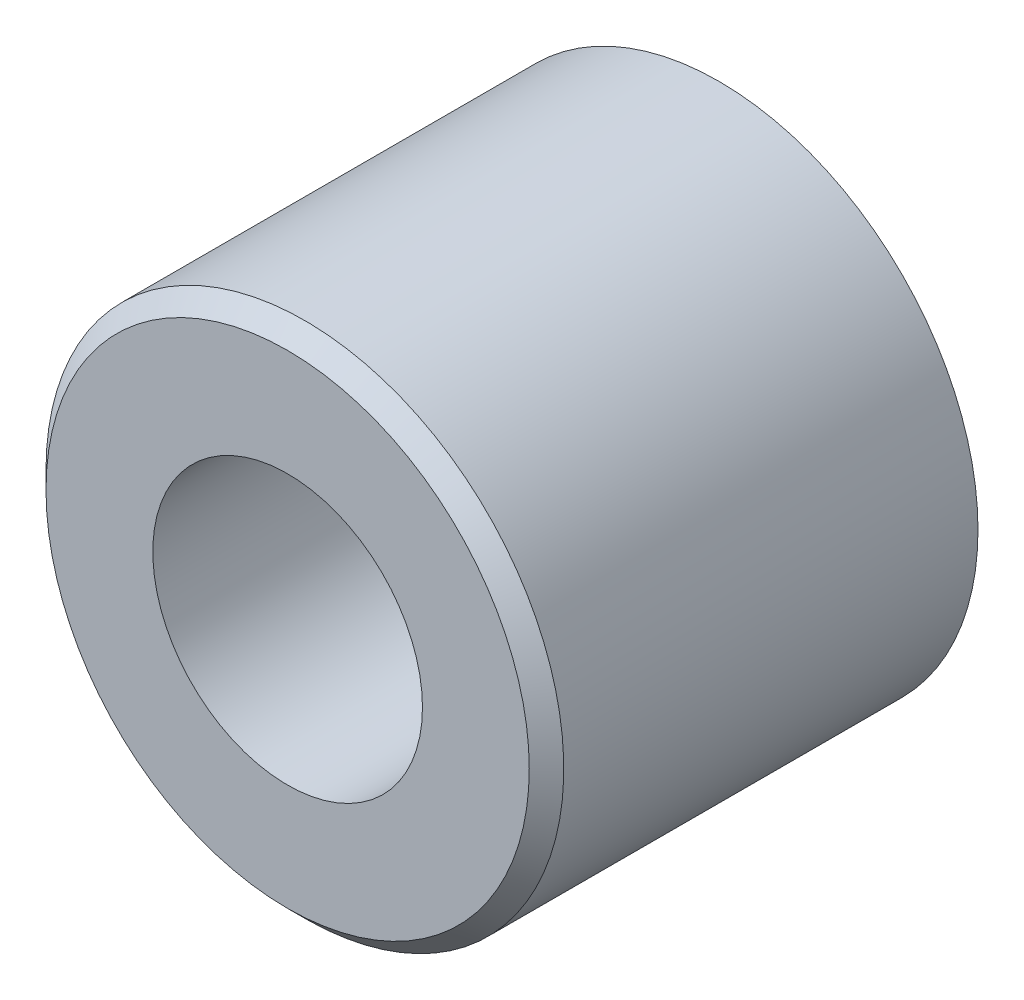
from build123d import *

# Parameters (mm, degrees)
CROQUIS1_R              = 6
CROQUIS1_R_2            = 3.125
SALIENTE_EXTRUIR1_DEPTH = 10
CHAFL_N1_SIZE           = 0.4


with BuildPart() as part:
    # Croquis1 → Saliente-Extruir1 (new body)
    with BuildSketch(Plane.XY):
        Circle(CROQUIS1_R)
        Circle(CROQUIS1_R_2, mode=Mode.SUBTRACT)
    extrude(amount=SALIENTE_EXTRUIR1_DEPTH)

    # Chafl_n1
    chafl_n1_edges = [part.edges().sort_by_distance(p)[0] for p in [
        (-6, 0, 10),
    ]]
    chamfer(chafl_n1_edges, length=CHAFL_N1_SIZE)


solid = part.part
